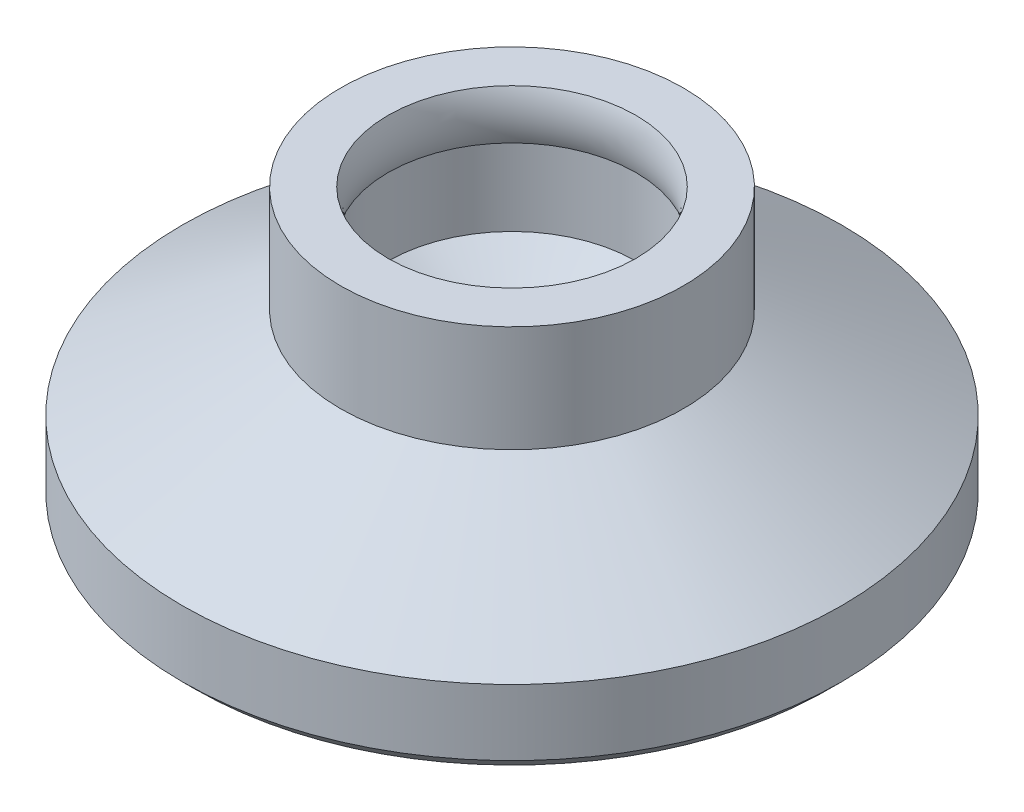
ISO-10303-21;
HEADER;
FILE_DESCRIPTION(('STEP AP214'),'2;1');
FILE_NAME('part.step','',(''),(''),'','','');
FILE_SCHEMA(('AUTOMOTIVE_DESIGN { 1 0 10303 214 1 1 1 1 }'));
ENDSEC;
DATA;
#1=APPLICATION_CONTEXT('core data for automotive mechanical design processes');
#2=APPLICATION_PROTOCOL_DEFINITION('international standard','automotive_design',2000,#1);
#3=PRODUCT_CONTEXT('',#1,'mechanical');
#4=PRODUCT('Part','Part','',(#3));
#5=PRODUCT_RELATED_PRODUCT_CATEGORY('part','',(#4));
#6=PRODUCT_DEFINITION_FORMATION('','',#4);
#7=PRODUCT_DEFINITION_CONTEXT('part definition',#1,'design');
#8=PRODUCT_DEFINITION('design','',#6,#7);
#9=PRODUCT_DEFINITION_SHAPE('','',#8);
#10=(LENGTH_UNIT() NAMED_UNIT(*) SI_UNIT(.MILLI.,.METRE.));
#11=(NAMED_UNIT(*) PLANE_ANGLE_UNIT() SI_UNIT($,.RADIAN.));
#12=(NAMED_UNIT(*) SI_UNIT($,.STERADIAN.) SOLID_ANGLE_UNIT());
#13=UNCERTAINTY_MEASURE_WITH_UNIT(LENGTH_MEASURE(1.E-05),#10,'distance_accuracy_value','');
#14=(GEOMETRIC_REPRESENTATION_CONTEXT(3) GLOBAL_UNCERTAINTY_ASSIGNED_CONTEXT((#13)) GLOBAL_UNIT_ASSIGNED_CONTEXT((#10,
#11,#12)) REPRESENTATION_CONTEXT('',''));
#15=CARTESIAN_POINT('',(0.,0.,0.));
#16=DIRECTION('',(0.,0.,1.));
#17=DIRECTION('',(1.,0.,0.));
#18=AXIS2_PLACEMENT_3D('',#15,#16,#17);
#19=CARTESIAN_POINT('',(0.,5.25,0.));
#20=DIRECTION('',(0.,-1.,0.));
#21=DIRECTION('',(0.,0.,-1.));
#22=AXIS2_PLACEMENT_3D('',#19,#20,#21);
#23=CYLINDRICAL_SURFACE('',#22,6.5);
#24=CARTESIAN_POINT('',(0.,1.21410161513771,0.));
#25=DIRECTION('',(0.,1.,0.));
#26=DIRECTION('',(0.,0.,1.));
#27=AXIS2_PLACEMENT_3D('',#24,#25,#26);
#28=CIRCLE('',#27,6.5);
#29=CARTESIAN_POINT('',(0.,1.21410161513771,-6.5));
#30=VERTEX_POINT('',#29);
#31=EDGE_CURVE('E91',#30,#30,#28,.T.);
#32=CARTESIAN_POINT('',(0.,5.25,0.));
#33=DIRECTION('',(0.,1.,0.));
#34=DIRECTION('',(0.,0.,1.));
#35=AXIS2_PLACEMENT_3D('',#32,#33,#34);
#36=CIRCLE('',#35,6.5);
#37=CARTESIAN_POINT('',(0.,5.25,-6.5));
#38=VERTEX_POINT('',#37);
#39=EDGE_CURVE('E93',#38,#38,#36,.T.);
#40=CARTESIAN_POINT('',(0.,1.21410161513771,-6.5));
#41=CARTESIAN_POINT('',(0.,1.25614222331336,-6.5));
#42=CARTESIAN_POINT('',(0.,1.29818283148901,-6.5));
#43=CARTESIAN_POINT('',(0.,1.3822640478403,-6.5));
#44=CARTESIAN_POINT('',(0.,1.42430465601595,-6.5));
#45=CARTESIAN_POINT('',(0.,1.50838587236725,-6.5));
#46=CARTESIAN_POINT('',(0.,1.5504264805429,-6.5));
#47=CARTESIAN_POINT('',(0.,1.6345076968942,-6.5));
#48=CARTESIAN_POINT('',(0.,1.67654830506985,-6.5));
#49=CARTESIAN_POINT('',(0.,1.76062952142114,-6.5));
#50=CARTESIAN_POINT('',(0.,1.80267012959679,-6.5));
#51=CARTESIAN_POINT('',(0.,1.88675134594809,-6.5));
#52=CARTESIAN_POINT('',(0.,1.92879195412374,-6.5));
#53=CARTESIAN_POINT('',(0.,2.01287317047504,-6.5));
#54=CARTESIAN_POINT('',(0.,2.05491377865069,-6.5));
#55=CARTESIAN_POINT('',(0.,2.13899499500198,-6.5));
#56=CARTESIAN_POINT('',(0.,2.18103560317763,-6.5));
#57=CARTESIAN_POINT('',(0.,2.26511681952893,-6.5));
#58=CARTESIAN_POINT('',(0.,2.30715742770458,-6.5));
#59=CARTESIAN_POINT('',(0.,2.39123864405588,-6.5));
#60=CARTESIAN_POINT('',(0.,2.43327925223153,-6.5));
#61=CARTESIAN_POINT('',(0.,2.51736046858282,-6.5));
#62=CARTESIAN_POINT('',(0.,2.55940107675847,-6.5));
#63=CARTESIAN_POINT('',(0.,2.64348229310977,-6.5));
#64=CARTESIAN_POINT('',(0.,2.68552290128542,-6.5));
#65=CARTESIAN_POINT('',(0.,2.76960411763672,-6.5));
#66=CARTESIAN_POINT('',(0.,2.81164472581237,-6.5));
#67=CARTESIAN_POINT('',(0.,2.89572594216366,-6.5));
#68=CARTESIAN_POINT('',(0.,2.93776655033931,-6.5));
#69=CARTESIAN_POINT('',(0.,3.02184776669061,-6.5));
#70=CARTESIAN_POINT('',(0.,3.06388837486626,-6.5));
#71=CARTESIAN_POINT('',(0.,3.14796959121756,-6.5));
#72=CARTESIAN_POINT('',(0.,3.19001019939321,-6.5));
#73=CARTESIAN_POINT('',(0.,3.2740914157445,-6.5));
#74=CARTESIAN_POINT('',(0.,3.31613202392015,-6.5));
#75=CARTESIAN_POINT('',(0.,3.40021324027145,-6.5));
#76=CARTESIAN_POINT('',(0.,3.4422538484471,-6.5));
#77=CARTESIAN_POINT('',(0.,3.5263350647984,-6.5));
#78=CARTESIAN_POINT('',(0.,3.56837567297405,-6.5));
#79=CARTESIAN_POINT('',(0.,3.65245688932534,-6.5));
#80=CARTESIAN_POINT('',(0.,3.69449749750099,-6.5));
#81=CARTESIAN_POINT('',(0.,3.77857871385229,-6.5));
#82=CARTESIAN_POINT('',(0.,3.82061932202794,-6.5));
#83=CARTESIAN_POINT('',(0.,3.90470053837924,-6.5));
#84=CARTESIAN_POINT('',(0.,3.94674114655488,-6.5));
#85=CARTESIAN_POINT('',(0.,4.03082236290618,-6.5));
#86=CARTESIAN_POINT('',(0.,4.07286297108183,-6.5));
#87=CARTESIAN_POINT('',(0.,4.15694418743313,-6.5));
#88=CARTESIAN_POINT('',(0.,4.19898479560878,-6.5));
#89=CARTESIAN_POINT('',(0.,4.28306601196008,-6.5));
#90=CARTESIAN_POINT('',(0.,4.32510662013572,-6.5));
#91=CARTESIAN_POINT('',(0.,4.40918783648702,-6.5));
#92=CARTESIAN_POINT('',(0.,4.45122844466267,-6.5));
#93=CARTESIAN_POINT('',(0.,4.53530966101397,-6.5));
#94=CARTESIAN_POINT('',(0.,4.57735026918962,-6.5));
#95=CARTESIAN_POINT('',(0.,4.66143148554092,-6.5));
#96=CARTESIAN_POINT('',(0.,4.70347209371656,-6.5));
#97=CARTESIAN_POINT('',(0.,4.78755331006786,-6.5));
#98=CARTESIAN_POINT('',(0.,4.82959391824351,-6.5));
#99=CARTESIAN_POINT('',(0.,4.91367513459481,-6.5));
#100=CARTESIAN_POINT('',(0.,4.95571574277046,-6.5));
#101=CARTESIAN_POINT('',(0.,5.03979695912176,-6.5));
#102=CARTESIAN_POINT('',(0.,5.0818375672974,-6.5));
#103=CARTESIAN_POINT('',(0.,5.1659187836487,-6.5));
#104=CARTESIAN_POINT('',(0.,5.20795939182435,-6.5));
#105=CARTESIAN_POINT('',(0.,5.25,-6.5));
#106=B_SPLINE_CURVE_WITH_KNOTS('',3,(#40,#41,#42,#43,#44,#45,#46,#47,#48,#49,#50,#51,#52,#53,
#54,#55,#56,#57,#58,#59,#60,#61,#62,#63,#64,#65,#66,#67,#68,#69,#70,#71,#72,#73,#74,#75,#76,#77,
#78,#79,#80,#81,#82,#83,#84,#85,#86,#87,#88,#89,#90,#91,#92,#93,#94,#95,#96,#97,#98,#99,#100,
#101,#102,#103,#104,#105),.UNSPECIFIED.,.F.,.F.,(4,2,2,2,2,2,2,2,2,2,2,2,2,2,2,2,2,2,2,2,2,2,2,
2,2,2,2,2,2,2,2,2,4),(0.,0.126121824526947,0.252243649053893,0.378365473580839,
0.504487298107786,0.630609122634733,0.756730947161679,0.882852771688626,1.00897459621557,
1.13509642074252,1.26121824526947,1.38734006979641,1.51346189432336,1.63958371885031,
1.76570554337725,1.8918273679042,2.01794919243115,2.14407101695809,2.27019284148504,
2.39631466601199,2.52243649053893,2.64855831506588,2.77468013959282,2.90080196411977,
3.02692378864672,3.15304561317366,3.27916743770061,3.40528926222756,3.5314110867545,
3.65753291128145,3.7836547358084,3.90977656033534,4.03589838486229),.UNSPECIFIED.);
#107=EDGE_CURVE('BSEAM37',#30,#38,#106,.T.);
#108=ORIENTED_EDGE('',*,*,#31,.T.);
#109=ORIENTED_EDGE('',*,*,#39,.F.);
#110=ORIENTED_EDGE('',*,*,#107,.T.);
#111=ORIENTED_EDGE('',*,*,#107,.F.);
#112=EDGE_LOOP('',(#108,#110,#109,#111));
#113=FACE_BOUND('',#112,.T.);
#114=ADVANCED_FACE('F37',(#113),#23,.T.);
#115=CARTESIAN_POINT('',(0.,5.25,0.));
#116=DIRECTION('',(0.,1.,0.));
#117=DIRECTION('',(0.,0.,1.));
#118=AXIS2_PLACEMENT_3D('',#115,#116,#117);
#119=PLANE('',#118);
#120=CARTESIAN_POINT('',(0.,5.25,0.));
#121=DIRECTION('',(0.,-1.,0.));
#122=DIRECTION('',(0.,0.,-1.));
#123=AXIS2_PLACEMENT_3D('',#120,#121,#122);
#124=CIRCLE('',#123,4.7);
#125=CARTESIAN_POINT('',(0.,5.25,-4.7));
#126=VERTEX_POINT('',#125);
#127=EDGE_CURVE('E111',#126,#126,#124,.T.);
#128=ORIENTED_EDGE('',*,*,#127,.T.);
#129=EDGE_LOOP('',(#128));
#130=FACE_BOUND('',#129,.T.);
#131=ORIENTED_EDGE('',*,*,#39,.T.);
#132=EDGE_LOOP('',(#131));
#133=FACE_BOUND('',#132,.T.);
#134=ADVANCED_FACE('F65',(#130,#133),#119,.T.);
#135=CARTESIAN_POINT('',(0.,1.21410161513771,0.));
#136=DIRECTION('',(0.,-1.,0.));
#137=DIRECTION('',(0.,0.,-1.));
#138=AXIS2_PLACEMENT_3D('',#135,#136,#137);
#139=CONICAL_SURFACE('',#138,6.5,1.0471975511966);
#140=CARTESIAN_POINT('',(0.,-2.25,0.));
#141=DIRECTION('',(0.,1.,0.));
#142=DIRECTION('',(0.,0.,1.));
#143=AXIS2_PLACEMENT_3D('',#140,#141,#142);
#144=CIRCLE('',#143,12.5);
#145=CARTESIAN_POINT('',(0.,-2.25,12.5));
#146=VERTEX_POINT('',#145);
#147=EDGE_CURVE('E89',#146,#146,#144,.T.);
#148=ORIENTED_EDGE('',*,*,#147,.T.);
#149=EDGE_LOOP('',(#148));
#150=FACE_BOUND('',#149,.T.);
#151=ORIENTED_EDGE('',*,*,#31,.F.);
#152=EDGE_LOOP('',(#151));
#153=FACE_BOUND('',#152,.T.);
#154=ADVANCED_FACE('F70',(#150,#153),#139,.T.);
#155=CARTESIAN_POINT('',(0.,-5.25,0.));
#156=DIRECTION('',(0.,1.,0.));
#157=DIRECTION('',(0.,0.,1.));
#158=AXIS2_PLACEMENT_3D('',#155,#156,#157);
#159=PLANE('',#158);
#160=CARTESIAN_POINT('',(0.,-5.25,0.));
#161=DIRECTION('',(0.,1.,0.));
#162=DIRECTION('',(0.,0.,1.));
#163=AXIS2_PLACEMENT_3D('',#160,#161,#162);
#164=CIRCLE('',#163,12.);
#165=CARTESIAN_POINT('',(0.,-5.25,12.));
#166=VERTEX_POINT('',#165);
#167=EDGE_CURVE('E45',#166,#166,#164,.F.);
#168=ORIENTED_EDGE('',*,*,#167,.T.);
#169=EDGE_LOOP('',(#168));
#170=FACE_BOUND('',#169,.T.);
#171=ADVANCED_FACE('F76',(#170),#159,.F.);
#172=CARTESIAN_POINT('',(0.,-2.25,0.));
#173=DIRECTION('',(0.,-1.,0.));
#174=DIRECTION('',(0.,0.,-1.));
#175=AXIS2_PLACEMENT_3D('',#172,#173,#174);
#176=CYLINDRICAL_SURFACE('',#175,12.5);
#177=CARTESIAN_POINT('',(0.,-4.75,0.));
#178=DIRECTION('',(0.,1.,0.));
#179=DIRECTION('',(0.,0.,1.));
#180=AXIS2_PLACEMENT_3D('',#177,#178,#179);
#181=CIRCLE('',#180,12.5);
#182=CARTESIAN_POINT('',(0.,-4.75,12.5));
#183=VERTEX_POINT('',#182);
#184=EDGE_CURVE('E11',#183,#183,#181,.T.);
#185=ORIENTED_EDGE('',*,*,#184,.T.);
#186=EDGE_LOOP('',(#185));
#187=FACE_BOUND('',#186,.T.);
#188=ORIENTED_EDGE('',*,*,#147,.F.);
#189=EDGE_LOOP('',(#188));
#190=FACE_BOUND('',#189,.T.);
#191=ADVANCED_FACE('F60',(#187,#190),#176,.T.);
#192=CARTESIAN_POINT('',(0.,-5.25,0.));
#193=DIRECTION('',(0.,1.,0.));
#194=DIRECTION('',(0.,0.,1.));
#195=AXIS2_PLACEMENT_3D('',#192,#193,#194);
#196=CONICAL_SURFACE('',#195,12.,0.785398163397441);
#197=ORIENTED_EDGE('',*,*,#184,.F.);
#198=EDGE_LOOP('',(#197));
#199=FACE_BOUND('',#198,.T.);
#200=ORIENTED_EDGE('',*,*,#167,.F.);
#201=EDGE_LOOP('',(#200));
#202=FACE_BOUND('',#201,.T.);
#203=ADVANCED_FACE('F39',(#199,#202),#196,.T.);
#204=CARTESIAN_POINT('',(0.,-2.25,0.));
#205=DIRECTION('',(0.,1.,0.));
#206=DIRECTION('',(0.,0.,1.));
#207=AXIS2_PLACEMENT_3D('',#204,#205,#206);
#208=CONICAL_SURFACE('',#207,0.,1.04719755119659);
#209=CARTESIAN_POINT('',(0.,0.463546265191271,0.));
#210=DIRECTION('',(0.,-1.,0.));
#211=DIRECTION('',(0.,0.,-1.));
#212=AXIS2_PLACEMENT_3D('',#209,#210,#211);
#213=CIRCLE('',#212,4.7);
#214=CARTESIAN_POINT('',(0.,0.463546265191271,-4.7));
#215=VERTEX_POINT('',#214);
#216=EDGE_CURVE('E101',#215,#215,#213,.T.);
#217=ORIENTED_EDGE('',*,*,#216,.F.);
#218=EDGE_LOOP('',(#217));
#219=FACE_BOUND('',#218,.T.);
#220=CARTESIAN_POINT('',(0.,-2.25,0.));
#221=VERTEX_POINT('',#220);
#222=VERTEX_LOOP('',#221);
#223=FACE_BOUND('',#222,.T.);
#224=ADVANCED_FACE('F48',(#219,#223),#208,.F.);
#225=CARTESIAN_POINT('',(0.,0.,0.));
#226=DIRECTION('',(0.,-1.,0.));
#227=DIRECTION('',(0.,0.,-1.));
#228=AXIS2_PLACEMENT_3D('',#225,#226,#227);
#229=CYLINDRICAL_SURFACE('',#228,4.7);
#230=CARTESIAN_POINT('',(0.,3.37,0.));
#231=DIRECTION('',(0.,-1.,0.));
#232=DIRECTION('',(0.,0.,-1.));
#233=AXIS2_PLACEMENT_3D('',#230,#231,#232);
#234=CIRCLE('',#233,4.7);
#235=CARTESIAN_POINT('',(0.,3.37,-4.7));
#236=VERTEX_POINT('',#235);
#237=EDGE_CURVE('E109',#236,#236,#234,.T.);
#238=ORIENTED_EDGE('',*,*,#237,.F.);
#239=EDGE_LOOP('',(#238));
#240=FACE_BOUND('',#239,.T.);
#241=ORIENTED_EDGE('',*,*,#216,.T.);
#242=EDGE_LOOP('',(#241));
#243=FACE_BOUND('',#242,.T.);
#244=ADVANCED_FACE('F50',(#240,#243),#229,.F.);
#245=CARTESIAN_POINT('',(0.,4.31,0.));
#246=DIRECTION('',(0.,-1.,0.));
#247=DIRECTION('',(0.,0.,-1.));
#248=AXIS2_PLACEMENT_3D('',#245,#246,#247);
#249=TOROIDAL_SURFACE('',#248,6.956,2.444);
#250=ORIENTED_EDGE('',*,*,#127,.F.);
#251=EDGE_LOOP('',(#250));
#252=FACE_BOUND('',#251,.T.);
#253=ORIENTED_EDGE('',*,*,#237,.T.);
#254=EDGE_LOOP('',(#253));
#255=FACE_BOUND('',#254,.T.);
#256=ADVANCED_FACE('F57',(#252,#255),#249,.T.);
#257=CLOSED_SHELL('',(#114,#134,#154,#171,#191,#203,#224,#244,#256));
#258=MANIFOLD_SOLID_BREP('B2',#257);
#259=ADVANCED_BREP_SHAPE_REPRESENTATION('',(#18,#258),#14);
#260=SHAPE_DEFINITION_REPRESENTATION(#9,#259);
ENDSEC;
END-ISO-10303-21;
